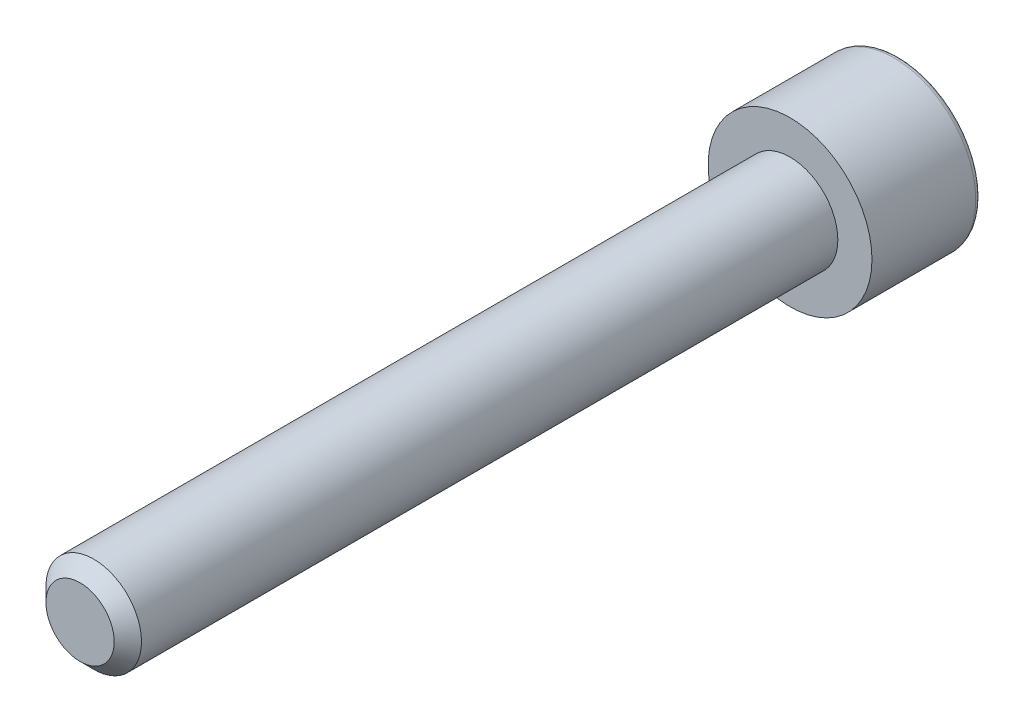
from build123d import *

# Parameters (mm, degrees)
ESQUISSE1_R             = 3
BOSS_EXTRU_1_DEPTH      = 30
CONG_1_R                = 0.2
ENL_V_MAT_EXTRU_2_DEPTH = 3.5
CONG_2_R                = 0.2
ESQUISSE2_OUTSIDE_W     = 14.236
ESQUISSE2_OUTSIDE_H     = 14.236
ESQUISSE2_OUTSIDE_R     = 1.75
ENL_V_MAT_EXTRU_3_DEPTH = 26
CHANFREIN1_SIZE         = 0.5


with BuildPart() as part:
    # Esquisse1 → Boss.-Extru.1 (new body)
    with BuildSketch(Plane.XY):
        Circle(ESQUISSE1_R)
    extrude(amount=BOSS_EXTRU_1_DEPTH)

    # Cong_1
    cong_1_edges = [part.edges().sort_by_distance(p)[0] for p in [
        (-3, 0, 0),
    ]]
    fillet(cong_1_edges, radius=CONG_1_R)

    # Esquisse3 → Enl_v. mat.-Extru.2 (cut)
    with BuildSketch(Plane(origin=(0, 0, 0), x_dir=(-1, 0, 0), z_dir=(0, 0, -1))):
        Polygon((1.010362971, -1.75), (2.020725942, 0), (1.010362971, 1.75), (-1.010362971, 1.75), (-2.020725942, 0), (-1.010362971, -1.75), align=None)
    extrude(amount=-ENL_V_MAT_EXTRU_2_DEPTH, mode=Mode.SUBTRACT)

    # Cong_2
    cong_2_edges = [part.edges().sort_by_distance(p)[0] for p in [
        (0, -1.75, 3.5),
        (1.515544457, -0.875, 3.5),
        (1.515544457, 0.875, 3.5),
        (0, 1.75, 3.5),
        (-1.515544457, 0.875, 3.5),
        (-1.515544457, -0.875, 3.5),
    ]]
    fillet(cong_2_edges, radius=CONG_2_R)

    # Esquisse2 outside → Enl_v. mat.-Extru.3 (cut)
    with BuildSketch(Plane.XY.offset(30)):
        Rectangle(ESQUISSE2_OUTSIDE_W, ESQUISSE2_OUTSIDE_H)
        Circle(ESQUISSE2_OUTSIDE_R, mode=Mode.SUBTRACT)
    extrude(amount=-ENL_V_MAT_EXTRU_3_DEPTH, mode=Mode.SUBTRACT)

    # Chanfrein1
    chanfrein1_edges = [part.edges().sort_by_distance(p)[0] for p in [
        (-1.75, 0, 30),
    ]]
    chamfer(chanfrein1_edges, length=CHANFREIN1_SIZE)


solid = part.part
